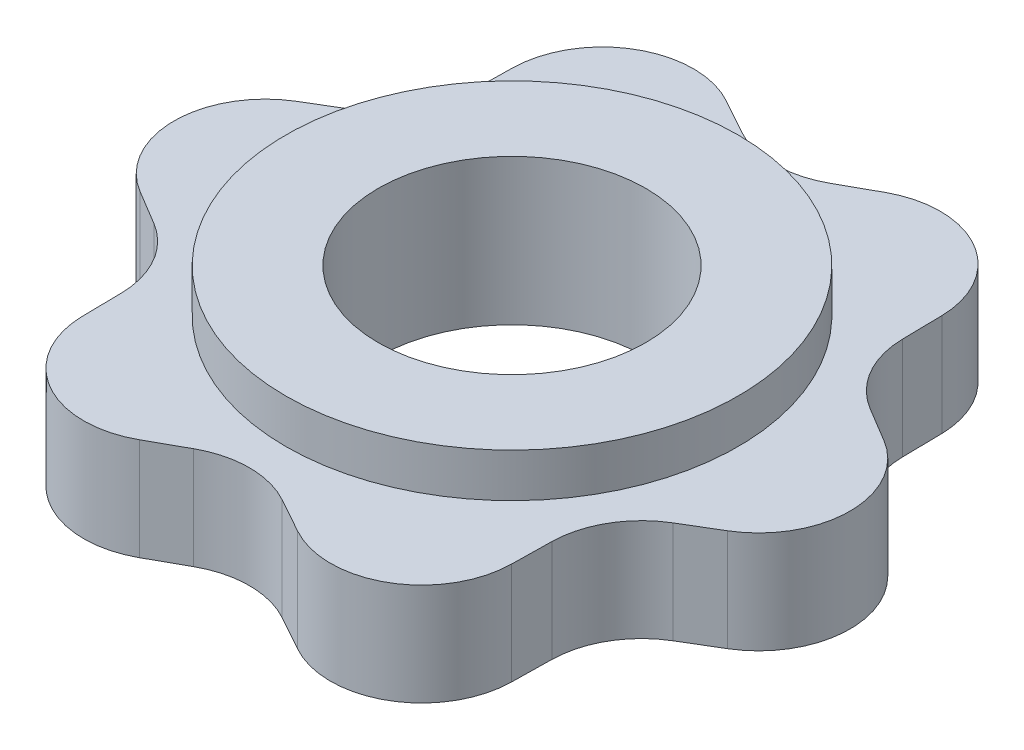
ISO-10303-21;
HEADER;
FILE_DESCRIPTION(('STEP AP214'),'2;1');
FILE_NAME('part.step','',(''),(''),'','','');
FILE_SCHEMA(('AUTOMOTIVE_DESIGN { 1 0 10303 214 1 1 1 1 }'));
ENDSEC;
DATA;
#1=APPLICATION_CONTEXT('core data for automotive mechanical design processes');
#2=APPLICATION_PROTOCOL_DEFINITION('international standard','automotive_design',2000,#1);
#3=PRODUCT_CONTEXT('',#1,'mechanical');
#4=PRODUCT('Part','Part','',(#3));
#5=PRODUCT_RELATED_PRODUCT_CATEGORY('part','',(#4));
#6=PRODUCT_DEFINITION_FORMATION('','',#4);
#7=PRODUCT_DEFINITION_CONTEXT('part definition',#1,'design');
#8=PRODUCT_DEFINITION('design','',#6,#7);
#9=PRODUCT_DEFINITION_SHAPE('','',#8);
#10=(LENGTH_UNIT() NAMED_UNIT(*) SI_UNIT(.MILLI.,.METRE.));
#11=(NAMED_UNIT(*) PLANE_ANGLE_UNIT() SI_UNIT($,.RADIAN.));
#12=(NAMED_UNIT(*) SI_UNIT($,.STERADIAN.) SOLID_ANGLE_UNIT());
#13=UNCERTAINTY_MEASURE_WITH_UNIT(LENGTH_MEASURE(1.E-05),#10,'distance_accuracy_value','');
#14=(GEOMETRIC_REPRESENTATION_CONTEXT(3) GLOBAL_UNCERTAINTY_ASSIGNED_CONTEXT((#13)) GLOBAL_UNIT_ASSIGNED_CONTEXT((#10,
#11,#12)) REPRESENTATION_CONTEXT('',''));
#15=CARTESIAN_POINT('',(0.,0.,0.));
#16=DIRECTION('',(0.,0.,1.));
#17=DIRECTION('',(1.,0.,0.));
#18=AXIS2_PLACEMENT_3D('',#15,#16,#17);
#19=CARTESIAN_POINT('',(0.,10.668,-36.957));
#20=DIRECTION('',(0.,1.,0.));
#21=DIRECTION('',(0.,0.,1.));
#22=AXIS2_PLACEMENT_3D('',#19,#20,#21);
#23=PLANE('',#22);
#24=CARTESIAN_POINT('',(0.,10.668,-36.957));
#25=DIRECTION('',(0.,-1.,0.));
#26=DIRECTION('',(0.,0.,1.));
#27=AXIS2_PLACEMENT_3D('',#24,#25,#26);
#28=CIRCLE('',#27,9.525);
#29=CARTESIAN_POINT('',(4.62754894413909,10.668,-28.6316522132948));
#30=VERTEX_POINT('',#29);
#31=CARTESIAN_POINT('',(-4.62754894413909,10.668,-28.6316522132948));
#32=VERTEX_POINT('',#31);
#33=EDGE_CURVE('E275',#30,#32,#28,.T.);
#34=ORIENTED_EDGE('',*,*,#33,.T.);
#35=DIRECTION('',(-0.874052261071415,0.,-0.485831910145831));
#36=VECTOR('',#35,1.);
#37=CARTESIAN_POINT('',(-8.26295105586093,10.668,-30.6523487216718));
#38=LINE('',#37,#36);
#39=CARTESIAN_POINT('',(-8.26295105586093,10.668,-30.6523487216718));
#40=VERTEX_POINT('',#39);
#41=EDGE_CURVE('E143',#32,#40,#38,.T.);
#42=ORIENTED_EDGE('',*,*,#41,.T.);
#43=CARTESIAN_POINT('',(-12.8905,10.668,-22.3270009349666));
#44=DIRECTION('',(0.,1.,0.));
#45=DIRECTION('',(0.,0.,1.));
#46=AXIS2_PLACEMENT_3D('',#43,#44,#45);
#47=CIRCLE('',#46,9.525);
#48=CARTESIAN_POINT('',(-22.4142371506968,10.668,-22.4820998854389));
#49=VERTEX_POINT('',#48);
#50=EDGE_CURVE('E338',#40,#49,#47,.T.);
#51=ORIENTED_EDGE('',*,*,#50,.T.);
#52=DIRECTION('',(-0.0162833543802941,0.,0.999867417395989));
#53=VECTOR('',#52,1.);
#54=CARTESIAN_POINT('',(-22.4819636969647,10.668,-18.3234010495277));
#55=LINE('',#54,#53);
#56=CARTESIAN_POINT('',(-22.4819636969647,10.668,-18.3234010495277));
#57=VERTEX_POINT('',#56);
#58=EDGE_CURVE('E356',#49,#57,#55,.T.);
#59=ORIENTED_EDGE('',*,*,#58,.T.);
#60=CARTESIAN_POINT('',(-32.0057008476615,10.668,-18.4785));
#61=DIRECTION('',(0.,-1.,0.));
#62=DIRECTION('',(0.,0.,1.));
#63=AXIS2_PLACEMENT_3D('',#60,#61,#62);
#64=CIRCLE('',#63,9.525);
#65=CARTESIAN_POINT('',(-27.1095126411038,10.668,-10.3082511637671));
#66=VERTEX_POINT('',#65);
#67=EDGE_CURVE('E353',#57,#66,#64,.T.);
#68=ORIENTED_EDGE('',*,*,#67,.T.);
#69=DIRECTION('',(-0.857768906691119,0.,0.514035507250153));
#70=VECTOR('',#69,1.);
#71=CARTESIAN_POINT('',(-27.1095126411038,10.668,-10.308251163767));
#72=LINE('',#71,#70);
#73=CARTESIAN_POINT('',(-30.6771882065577,10.668,-8.17024883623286));
#74=VERTEX_POINT('',#73);
#75=EDGE_CURVE('E355',#66,#74,#72,.T.);
#76=ORIENTED_EDGE('',*,*,#75,.T.);
#77=CARTESIAN_POINT('',(-25.781,10.668,0.));
#78=DIRECTION('',(0.,1.,0.));
#79=DIRECTION('',(0.,0.,1.));
#80=AXIS2_PLACEMENT_3D('',#77,#78,#79);
#81=CIRCLE('',#80,9.525);
#82=CARTESIAN_POINT('',(-30.6771882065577,10.668,8.17024883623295));
#83=VERTEX_POINT('',#82);
#84=EDGE_CURVE('E358',#74,#83,#81,.T.);
#85=ORIENTED_EDGE('',*,*,#84,.T.);
#86=DIRECTION('',(0.857768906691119,0.,0.514035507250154));
#87=VECTOR('',#86,1.);
#88=CARTESIAN_POINT('',(-27.1095126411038,10.668,10.3082511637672));
#89=LINE('',#88,#87);
#90=CARTESIAN_POINT('',(-27.1095126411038,10.668,10.3082511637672));
#91=VERTEX_POINT('',#90);
#92=EDGE_CURVE('E364',#83,#91,#89,.T.);
#93=ORIENTED_EDGE('',*,*,#92,.T.);
#94=CARTESIAN_POINT('',(-32.0057008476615,10.668,18.4785000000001));
#95=DIRECTION('',(0.,-1.,0.));
#96=DIRECTION('',(0.,0.,1.));
#97=AXIS2_PLACEMENT_3D('',#94,#95,#96);
#98=CIRCLE('',#97,9.525);
#99=CARTESIAN_POINT('',(-22.4819636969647,10.668,18.3234010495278));
#100=VERTEX_POINT('',#99);
#101=EDGE_CURVE('E366',#91,#100,#98,.T.);
#102=ORIENTED_EDGE('',*,*,#101,.T.);
#103=DIRECTION('',(0.0162833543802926,0.,0.999867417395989));
#104=VECTOR('',#103,1.);
#105=CARTESIAN_POINT('',(-22.4819636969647,10.668,18.3234010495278));
#106=LINE('',#105,#104);
#107=CARTESIAN_POINT('',(-22.4142371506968,10.668,22.4820998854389));
#108=VERTEX_POINT('',#107);
#109=EDGE_CURVE('E368',#100,#108,#106,.T.);
#110=ORIENTED_EDGE('',*,*,#109,.T.);
#111=CARTESIAN_POINT('',(-12.8905,10.668,22.3270009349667));
#112=DIRECTION('',(0.,1.,0.));
#113=DIRECTION('',(0.,0.,1.));
#114=AXIS2_PLACEMENT_3D('',#111,#112,#113);
#115=CIRCLE('',#114,9.525);
#116=CARTESIAN_POINT('',(-8.2629510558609,10.668,30.6523487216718));
#117=VERTEX_POINT('',#116);
#118=EDGE_CURVE('E370',#108,#117,#115,.T.);
#119=ORIENTED_EDGE('',*,*,#118,.T.);
#120=DIRECTION('',(0.874052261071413,0.,-0.485831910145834));
#121=VECTOR('',#120,1.);
#122=CARTESIAN_POINT('',(-4.62754894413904,10.668,28.6316522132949));
#123=LINE('',#122,#121);
#124=CARTESIAN_POINT('',(-4.62754894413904,10.668,28.6316522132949));
#125=VERTEX_POINT('',#124);
#126=EDGE_CURVE('E372',#117,#125,#123,.T.);
#127=ORIENTED_EDGE('',*,*,#126,.T.);
#128=CARTESIAN_POINT('',(0.,10.668,36.9570000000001));
#129=DIRECTION('',(0.,-1.,0.));
#130=DIRECTION('',(0.,0.,1.));
#131=AXIS2_PLACEMENT_3D('',#128,#129,#130);
#132=CIRCLE('',#131,9.525);
#133=CARTESIAN_POINT('',(4.62754894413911,10.668,28.6316522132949));
#134=VERTEX_POINT('',#133);
#135=EDGE_CURVE('E374',#125,#134,#132,.T.);
#136=ORIENTED_EDGE('',*,*,#135,.T.);
#137=DIRECTION('',(0.874052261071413,0.,0.485831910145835));
#138=VECTOR('',#137,1.);
#139=CARTESIAN_POINT('',(4.62754894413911,10.668,28.6316522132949));
#140=LINE('',#139,#138);
#141=CARTESIAN_POINT('',(8.26295105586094,10.668,30.6523487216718));
#142=VERTEX_POINT('',#141);
#143=EDGE_CURVE('E376',#134,#142,#140,.T.);
#144=ORIENTED_EDGE('',*,*,#143,.T.);
#145=CARTESIAN_POINT('',(12.8905,10.668,22.3270009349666));
#146=DIRECTION('',(0.,1.,0.));
#147=DIRECTION('',(0.,0.,1.));
#148=AXIS2_PLACEMENT_3D('',#145,#146,#147);
#149=CIRCLE('',#148,9.525);
#150=CARTESIAN_POINT('',(22.4142371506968,10.668,22.4820998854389));
#151=VERTEX_POINT('',#150);
#152=EDGE_CURVE('E378',#142,#151,#149,.T.);
#153=ORIENTED_EDGE('',*,*,#152,.T.);
#154=DIRECTION('',(0.0162833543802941,0.,-0.999867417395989));
#155=VECTOR('',#154,1.);
#156=CARTESIAN_POINT('',(22.4819636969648,10.668,18.3234010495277));
#157=LINE('',#156,#155);
#158=CARTESIAN_POINT('',(22.4819636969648,10.668,18.3234010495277));
#159=VERTEX_POINT('',#158);
#160=EDGE_CURVE('E380',#151,#159,#157,.T.);
#161=ORIENTED_EDGE('',*,*,#160,.T.);
#162=CARTESIAN_POINT('',(32.0057008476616,10.668,18.4785));
#163=DIRECTION('',(0.,-1.,0.));
#164=DIRECTION('',(0.,0.,1.));
#165=AXIS2_PLACEMENT_3D('',#162,#163,#164);
#166=CIRCLE('',#165,9.525);
#167=CARTESIAN_POINT('',(27.1095126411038,10.668,10.3082511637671));
#168=VERTEX_POINT('',#167);
#169=EDGE_CURVE('E382',#159,#168,#166,.T.);
#170=ORIENTED_EDGE('',*,*,#169,.T.);
#171=DIRECTION('',(0.857768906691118,0.,-0.514035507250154));
#172=VECTOR('',#171,1.);
#173=CARTESIAN_POINT('',(27.1095126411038,10.668,10.3082511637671));
#174=LINE('',#173,#172);
#175=CARTESIAN_POINT('',(30.6771882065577,10.668,8.17024883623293));
#176=VERTEX_POINT('',#175);
#177=EDGE_CURVE('E384',#168,#176,#174,.T.);
#178=ORIENTED_EDGE('',*,*,#177,.T.);
#179=CARTESIAN_POINT('',(25.781,10.668,0.));
#180=DIRECTION('',(0.,1.,0.));
#181=DIRECTION('',(0.,0.,1.));
#182=AXIS2_PLACEMENT_3D('',#179,#180,#181);
#183=CIRCLE('',#182,9.525);
#184=CARTESIAN_POINT('',(30.6771882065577,10.668,-8.17024883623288));
#185=VERTEX_POINT('',#184);
#186=EDGE_CURVE('E386',#176,#185,#183,.T.);
#187=ORIENTED_EDGE('',*,*,#186,.T.);
#188=DIRECTION('',(-0.857768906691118,0.,-0.514035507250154));
#189=VECTOR('',#188,1.);
#190=CARTESIAN_POINT('',(27.1095126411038,10.668,-10.3082511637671));
#191=LINE('',#190,#189);
#192=CARTESIAN_POINT('',(27.1095126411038,10.668,-10.3082511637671));
#193=VERTEX_POINT('',#192);
#194=EDGE_CURVE('E388',#185,#193,#191,.T.);
#195=ORIENTED_EDGE('',*,*,#194,.T.);
#196=CARTESIAN_POINT('',(32.0057008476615,10.668,-18.4785));
#197=DIRECTION('',(0.,-1.,0.));
#198=DIRECTION('',(0.,0.,1.));
#199=AXIS2_PLACEMENT_3D('',#196,#197,#198);
#200=CIRCLE('',#199,9.525);
#201=CARTESIAN_POINT('',(22.4819636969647,10.668,-18.3234010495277));
#202=VERTEX_POINT('',#201);
#203=EDGE_CURVE('E210',#193,#202,#200,.T.);
#204=ORIENTED_EDGE('',*,*,#203,.T.);
#205=DIRECTION('',(-0.0162833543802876,0.,-0.99986741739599));
#206=VECTOR('',#205,1.);
#207=CARTESIAN_POINT('',(22.4142371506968,10.668,-22.4820998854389));
#208=LINE('',#207,#206);
#209=CARTESIAN_POINT('',(22.4142371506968,10.668,-22.4820998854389));
#210=VERTEX_POINT('',#209);
#211=EDGE_CURVE('E204',#202,#210,#208,.T.);
#212=ORIENTED_EDGE('',*,*,#211,.T.);
#213=CARTESIAN_POINT('',(12.8905,10.668,-22.3270009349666));
#214=DIRECTION('',(0.,1.,0.));
#215=DIRECTION('',(0.,0.,1.));
#216=AXIS2_PLACEMENT_3D('',#213,#214,#215);
#217=CIRCLE('',#216,9.525);
#218=CARTESIAN_POINT('',(8.26295105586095,10.668,-30.6523487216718));
#219=VERTEX_POINT('',#218);
#220=EDGE_CURVE('E208',#210,#219,#217,.T.);
#221=ORIENTED_EDGE('',*,*,#220,.T.);
#222=DIRECTION('',(-0.874052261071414,0.,0.485831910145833));
#223=VECTOR('',#222,1.);
#224=CARTESIAN_POINT('',(4.62754894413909,10.668,-28.6316522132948));
#225=LINE('',#224,#223);
#226=EDGE_CURVE('E52',#219,#30,#225,.T.);
#227=ORIENTED_EDGE('',*,*,#226,.T.);
#228=EDGE_LOOP('',(#34,#42,#51,#59,#68,#76,#85,#93,#102,#110,#119,#127,#136,#144,#153,#161,#170,
#178,#187,#195,#204,#212,#221,#227));
#229=FACE_BOUND('',#228,.T.);
#230=CARTESIAN_POINT('',(0.,10.668,0.));
#231=DIRECTION('',(0.,1.,0.));
#232=DIRECTION('',(0.,0.,1.));
#233=AXIS2_PLACEMENT_3D('',#230,#231,#232);
#234=CIRCLE('',#233,23.622);
#235=CARTESIAN_POINT('',(0.,10.668,23.622));
#236=VERTEX_POINT('',#235);
#237=EDGE_CURVE('E440',#236,#236,#234,.T.);
#238=ORIENTED_EDGE('',*,*,#237,.F.);
#239=EDGE_LOOP('',(#238));
#240=FACE_BOUND('',#239,.T.);
#241=ADVANCED_FACE('F35',(#229,#240),#23,.T.);
#242=CARTESIAN_POINT('',(0.,10.668,-36.957));
#243=DIRECTION('',(0.,-1.,0.));
#244=DIRECTION('',(0.,0.,-1.));
#245=AXIS2_PLACEMENT_3D('',#242,#243,#244);
#246=CYLINDRICAL_SURFACE('',#245,9.525);
#247=CARTESIAN_POINT('',(0.,0.,-36.957));
#248=DIRECTION('',(0.,-1.,0.));
#249=DIRECTION('',(0.,0.,1.));
#250=AXIS2_PLACEMENT_3D('',#247,#248,#249);
#251=CIRCLE('',#250,9.525);
#252=CARTESIAN_POINT('',(4.62754894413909,0.,-28.6316522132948));
#253=VERTEX_POINT('',#252);
#254=CARTESIAN_POINT('',(-4.62754894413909,0.,-28.6316522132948));
#255=VERTEX_POINT('',#254);
#256=EDGE_CURVE('E228',#253,#255,#251,.T.);
#257=ORIENTED_EDGE('',*,*,#256,.T.);
#258=DIRECTION('',(0.,-1.,0.));
#259=VECTOR('',#258,1.);
#260=CARTESIAN_POINT('',(-4.62754894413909,10.668,-28.6316522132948));
#261=LINE('',#260,#259);
#262=EDGE_CURVE('E11',#32,#255,#261,.T.);
#263=ORIENTED_EDGE('',*,*,#262,.F.);
#264=ORIENTED_EDGE('',*,*,#33,.F.);
#265=DIRECTION('',(0.,-1.,0.));
#266=VECTOR('',#265,1.);
#267=CARTESIAN_POINT('',(4.62754894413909,10.668,-28.6316522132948));
#268=LINE('',#267,#266);
#269=EDGE_CURVE('E224',#30,#253,#268,.T.);
#270=ORIENTED_EDGE('',*,*,#269,.T.);
#271=EDGE_LOOP('',(#257,#263,#264,#270));
#272=FACE_BOUND('',#271,.T.);
#273=ADVANCED_FACE('F37',(#272),#246,.F.);
#274=CARTESIAN_POINT('',(-8.26295105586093,10.668,-30.6523487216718));
#275=DIRECTION('',(-0.485831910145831,0.,0.874052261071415));
#276=DIRECTION('',(0.874052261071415,0.,0.485831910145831));
#277=AXIS2_PLACEMENT_3D('',#274,#275,#276);
#278=PLANE('',#277);
#279=DIRECTION('',(-0.874052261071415,0.,-0.485831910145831));
#280=VECTOR('',#279,1.);
#281=CARTESIAN_POINT('',(-8.26295105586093,0.,-30.6523487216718));
#282=LINE('',#281,#280);
#283=CARTESIAN_POINT('',(-8.26295105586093,0.,-30.6523487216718));
#284=VERTEX_POINT('',#283);
#285=EDGE_CURVE('E231',#255,#284,#282,.T.);
#286=ORIENTED_EDGE('',*,*,#285,.T.);
#287=DIRECTION('',(0.,-1.,0.));
#288=VECTOR('',#287,1.);
#289=CARTESIAN_POINT('',(-8.26295105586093,10.668,-30.6523487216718));
#290=LINE('',#289,#288);
#291=EDGE_CURVE('E44',#40,#284,#290,.T.);
#292=ORIENTED_EDGE('',*,*,#291,.F.);
#293=ORIENTED_EDGE('',*,*,#41,.F.);
#294=ORIENTED_EDGE('',*,*,#262,.T.);
#295=EDGE_LOOP('',(#286,#292,#293,#294));
#296=FACE_BOUND('',#295,.T.);
#297=ADVANCED_FACE('F418',(#296),#278,.F.);
#298=CARTESIAN_POINT('',(-12.8905,10.668,-22.3270009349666));
#299=DIRECTION('',(0.,-1.,0.));
#300=DIRECTION('',(0.,0.,-1.));
#301=AXIS2_PLACEMENT_3D('',#298,#299,#300);
#302=CYLINDRICAL_SURFACE('',#301,9.525);
#303=CARTESIAN_POINT('',(-12.8905,0.,-22.3270009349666));
#304=DIRECTION('',(0.,1.,0.));
#305=DIRECTION('',(0.,0.,1.));
#306=AXIS2_PLACEMENT_3D('',#303,#304,#305);
#307=CIRCLE('',#306,9.525);
#308=CARTESIAN_POINT('',(-22.4142371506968,0.,-22.4820998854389));
#309=VERTEX_POINT('',#308);
#310=EDGE_CURVE('E234',#284,#309,#307,.T.);
#311=ORIENTED_EDGE('',*,*,#310,.T.);
#312=DIRECTION('',(0.,-1.,0.));
#313=VECTOR('',#312,1.);
#314=CARTESIAN_POINT('',(-22.4142371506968,10.668,-22.4820998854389));
#315=LINE('',#314,#313);
#316=EDGE_CURVE('E330',#49,#309,#315,.T.);
#317=ORIENTED_EDGE('',*,*,#316,.F.);
#318=ORIENTED_EDGE('',*,*,#50,.F.);
#319=ORIENTED_EDGE('',*,*,#291,.T.);
#320=EDGE_LOOP('',(#311,#317,#318,#319));
#321=FACE_BOUND('',#320,.T.);
#322=ADVANCED_FACE('F336',(#321),#302,.T.);
#323=CARTESIAN_POINT('',(-22.4819636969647,10.668,-18.3234010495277));
#324=DIRECTION('',(0.999867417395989,0.,0.0162833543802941));
#325=DIRECTION('',(0.0162833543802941,0.,-0.999867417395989));
#326=AXIS2_PLACEMENT_3D('',#323,#324,#325);
#327=PLANE('',#326);
#328=DIRECTION('',(-0.0162833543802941,0.,0.999867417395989));
#329=VECTOR('',#328,1.);
#330=CARTESIAN_POINT('',(-22.4819636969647,0.,-18.3234010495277));
#331=LINE('',#330,#329);
#332=CARTESIAN_POINT('',(-22.4819636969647,0.,-18.3234010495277));
#333=VERTEX_POINT('',#332);
#334=EDGE_CURVE('E236',#309,#333,#331,.T.);
#335=ORIENTED_EDGE('',*,*,#334,.T.);
#336=DIRECTION('',(0.,-1.,0.));
#337=VECTOR('',#336,1.);
#338=CARTESIAN_POINT('',(-22.4819636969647,10.668,-18.3234010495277));
#339=LINE('',#338,#337);
#340=EDGE_CURVE('E327',#57,#333,#339,.T.);
#341=ORIENTED_EDGE('',*,*,#340,.F.);
#342=ORIENTED_EDGE('',*,*,#58,.F.);
#343=ORIENTED_EDGE('',*,*,#316,.T.);
#344=EDGE_LOOP('',(#335,#341,#342,#343));
#345=FACE_BOUND('',#344,.T.);
#346=ADVANCED_FACE('F347',(#345),#327,.F.);
#347=CARTESIAN_POINT('',(-32.0057008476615,10.668,-18.4785));
#348=DIRECTION('',(0.,-1.,0.));
#349=DIRECTION('',(0.,0.,-1.));
#350=AXIS2_PLACEMENT_3D('',#347,#348,#349);
#351=CYLINDRICAL_SURFACE('',#350,9.525);
#352=CARTESIAN_POINT('',(-32.0057008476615,0.,-18.4785));
#353=DIRECTION('',(0.,-1.,0.));
#354=DIRECTION('',(0.,0.,1.));
#355=AXIS2_PLACEMENT_3D('',#352,#353,#354);
#356=CIRCLE('',#355,9.525);
#357=CARTESIAN_POINT('',(-27.1095126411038,0.,-10.3082511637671));
#358=VERTEX_POINT('',#357);
#359=EDGE_CURVE('E238',#333,#358,#356,.T.);
#360=ORIENTED_EDGE('',*,*,#359,.T.);
#361=DIRECTION('',(0.,-1.,0.));
#362=VECTOR('',#361,1.);
#363=CARTESIAN_POINT('',(-27.1095126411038,10.668,-10.3082511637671));
#364=LINE('',#363,#362);
#365=EDGE_CURVE('E324',#66,#358,#364,.T.);
#366=ORIENTED_EDGE('',*,*,#365,.F.);
#367=ORIENTED_EDGE('',*,*,#67,.F.);
#368=ORIENTED_EDGE('',*,*,#340,.T.);
#369=EDGE_LOOP('',(#360,#366,#367,#368));
#370=FACE_BOUND('',#369,.T.);
#371=ADVANCED_FACE('F351',(#370),#351,.F.);
#372=CARTESIAN_POINT('',(-27.1095126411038,10.668,-10.308251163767));
#373=DIRECTION('',(0.514035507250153,0.,0.857768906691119));
#374=DIRECTION('',(0.857768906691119,0.,-0.514035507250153));
#375=AXIS2_PLACEMENT_3D('',#372,#373,#374);
#376=PLANE('',#375);
#377=DIRECTION('',(-0.857768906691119,0.,0.514035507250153));
#378=VECTOR('',#377,1.);
#379=CARTESIAN_POINT('',(-27.1095126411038,0.,-10.308251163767));
#380=LINE('',#379,#378);
#381=CARTESIAN_POINT('',(-30.6771882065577,0.,-8.17024883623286));
#382=VERTEX_POINT('',#381);
#383=EDGE_CURVE('E240',#358,#382,#380,.T.);
#384=ORIENTED_EDGE('',*,*,#383,.T.);
#385=DIRECTION('',(0.,-1.,0.));
#386=VECTOR('',#385,1.);
#387=CARTESIAN_POINT('',(-30.6771882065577,10.668,-8.17024883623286));
#388=LINE('',#387,#386);
#389=EDGE_CURVE('E321',#74,#382,#388,.T.);
#390=ORIENTED_EDGE('',*,*,#389,.F.);
#391=ORIENTED_EDGE('',*,*,#75,.F.);
#392=ORIENTED_EDGE('',*,*,#365,.T.);
#393=EDGE_LOOP('',(#384,#390,#391,#392));
#394=FACE_BOUND('',#393,.T.);
#395=ADVANCED_FACE('F638',(#394),#376,.F.);
#396=CARTESIAN_POINT('',(-25.781,10.668,0.));
#397=DIRECTION('',(0.,-1.,0.));
#398=DIRECTION('',(0.,0.,-1.));
#399=AXIS2_PLACEMENT_3D('',#396,#397,#398);
#400=CYLINDRICAL_SURFACE('',#399,9.525);
#401=CARTESIAN_POINT('',(-25.781,0.,0.));
#402=DIRECTION('',(0.,1.,0.));
#403=DIRECTION('',(0.,0.,1.));
#404=AXIS2_PLACEMENT_3D('',#401,#402,#403);
#405=CIRCLE('',#404,9.525);
#406=CARTESIAN_POINT('',(-30.6771882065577,0.,8.17024883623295));
#407=VERTEX_POINT('',#406);
#408=EDGE_CURVE('E242',#382,#407,#405,.T.);
#409=ORIENTED_EDGE('',*,*,#408,.T.);
#410=DIRECTION('',(0.,-1.,0.));
#411=VECTOR('',#410,1.);
#412=CARTESIAN_POINT('',(-30.6771882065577,10.668,8.17024883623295));
#413=LINE('',#412,#411);
#414=EDGE_CURVE('E318',#83,#407,#413,.T.);
#415=ORIENTED_EDGE('',*,*,#414,.F.);
#416=ORIENTED_EDGE('',*,*,#84,.F.);
#417=ORIENTED_EDGE('',*,*,#389,.T.);
#418=EDGE_LOOP('',(#409,#415,#416,#417));
#419=FACE_BOUND('',#418,.T.);
#420=ADVANCED_FACE('F628',(#419),#400,.T.);
#421=CARTESIAN_POINT('',(-27.1095126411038,10.668,10.3082511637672));
#422=DIRECTION('',(0.514035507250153,0.,-0.857768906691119));
#423=DIRECTION('',(-0.857768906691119,0.,-0.514035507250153));
#424=AXIS2_PLACEMENT_3D('',#421,#422,#423);
#425=PLANE('',#424);
#426=DIRECTION('',(0.857768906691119,0.,0.514035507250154));
#427=VECTOR('',#426,1.);
#428=CARTESIAN_POINT('',(-27.1095126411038,0.,10.3082511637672));
#429=LINE('',#428,#427);
#430=CARTESIAN_POINT('',(-27.1095126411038,0.,10.3082511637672));
#431=VERTEX_POINT('',#430);
#432=EDGE_CURVE('E244',#407,#431,#429,.T.);
#433=ORIENTED_EDGE('',*,*,#432,.T.);
#434=DIRECTION('',(0.,-1.,0.));
#435=VECTOR('',#434,1.);
#436=CARTESIAN_POINT('',(-27.1095126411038,10.668,10.3082511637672));
#437=LINE('',#436,#435);
#438=EDGE_CURVE('E315',#91,#431,#437,.T.);
#439=ORIENTED_EDGE('',*,*,#438,.F.);
#440=ORIENTED_EDGE('',*,*,#92,.F.);
#441=ORIENTED_EDGE('',*,*,#414,.T.);
#442=EDGE_LOOP('',(#433,#439,#440,#441));
#443=FACE_BOUND('',#442,.T.);
#444=ADVANCED_FACE('F618',(#443),#425,.F.);
#445=CARTESIAN_POINT('',(-32.0057008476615,10.668,18.4785000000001));
#446=DIRECTION('',(0.,-1.,0.));
#447=DIRECTION('',(0.,0.,-1.));
#448=AXIS2_PLACEMENT_3D('',#445,#446,#447);
#449=CYLINDRICAL_SURFACE('',#448,9.525);
#450=CARTESIAN_POINT('',(-32.0057008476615,0.,18.4785000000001));
#451=DIRECTION('',(0.,-1.,0.));
#452=DIRECTION('',(0.,0.,1.));
#453=AXIS2_PLACEMENT_3D('',#450,#451,#452);
#454=CIRCLE('',#453,9.525);
#455=CARTESIAN_POINT('',(-22.4819636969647,0.,18.3234010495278));
#456=VERTEX_POINT('',#455);
#457=EDGE_CURVE('E246',#431,#456,#454,.T.);
#458=ORIENTED_EDGE('',*,*,#457,.T.);
#459=DIRECTION('',(0.,-1.,0.));
#460=VECTOR('',#459,1.);
#461=CARTESIAN_POINT('',(-22.4819636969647,10.668,18.3234010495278));
#462=LINE('',#461,#460);
#463=EDGE_CURVE('E312',#100,#456,#462,.T.);
#464=ORIENTED_EDGE('',*,*,#463,.F.);
#465=ORIENTED_EDGE('',*,*,#101,.F.);
#466=ORIENTED_EDGE('',*,*,#438,.T.);
#467=EDGE_LOOP('',(#458,#464,#465,#466));
#468=FACE_BOUND('',#467,.T.);
#469=ADVANCED_FACE('F608',(#468),#449,.F.);
#470=CARTESIAN_POINT('',(-22.4819636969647,10.668,18.3234010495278));
#471=DIRECTION('',(0.999867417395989,0.,-0.0162833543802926));
#472=DIRECTION('',(-0.0162833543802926,0.,-0.999867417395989));
#473=AXIS2_PLACEMENT_3D('',#470,#471,#472);
#474=PLANE('',#473);
#475=DIRECTION('',(0.0162833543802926,0.,0.999867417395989));
#476=VECTOR('',#475,1.);
#477=CARTESIAN_POINT('',(-22.4819636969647,0.,18.3234010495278));
#478=LINE('',#477,#476);
#479=CARTESIAN_POINT('',(-22.4142371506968,0.,22.4820998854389));
#480=VERTEX_POINT('',#479);
#481=EDGE_CURVE('E248',#456,#480,#478,.T.);
#482=ORIENTED_EDGE('',*,*,#481,.T.);
#483=DIRECTION('',(0.,-1.,0.));
#484=VECTOR('',#483,1.);
#485=CARTESIAN_POINT('',(-22.4142371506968,10.668,22.4820998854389));
#486=LINE('',#485,#484);
#487=EDGE_CURVE('E309',#108,#480,#486,.T.);
#488=ORIENTED_EDGE('',*,*,#487,.F.);
#489=ORIENTED_EDGE('',*,*,#109,.F.);
#490=ORIENTED_EDGE('',*,*,#463,.T.);
#491=EDGE_LOOP('',(#482,#488,#489,#490));
#492=FACE_BOUND('',#491,.T.);
#493=ADVANCED_FACE('F598',(#492),#474,.F.);
#494=CARTESIAN_POINT('',(-12.8905,10.668,22.3270009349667));
#495=DIRECTION('',(0.,-1.,0.));
#496=DIRECTION('',(0.,0.,-1.));
#497=AXIS2_PLACEMENT_3D('',#494,#495,#496);
#498=CYLINDRICAL_SURFACE('',#497,9.525);
#499=CARTESIAN_POINT('',(-12.8905,0.,22.3270009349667));
#500=DIRECTION('',(0.,1.,0.));
#501=DIRECTION('',(0.,0.,1.));
#502=AXIS2_PLACEMENT_3D('',#499,#500,#501);
#503=CIRCLE('',#502,9.525);
#504=CARTESIAN_POINT('',(-8.2629510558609,0.,30.6523487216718));
#505=VERTEX_POINT('',#504);
#506=EDGE_CURVE('E250',#480,#505,#503,.T.);
#507=ORIENTED_EDGE('',*,*,#506,.T.);
#508=DIRECTION('',(0.,-1.,0.));
#509=VECTOR('',#508,1.);
#510=CARTESIAN_POINT('',(-8.2629510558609,10.668,30.6523487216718));
#511=LINE('',#510,#509);
#512=EDGE_CURVE('E306',#117,#505,#511,.T.);
#513=ORIENTED_EDGE('',*,*,#512,.F.);
#514=ORIENTED_EDGE('',*,*,#118,.F.);
#515=ORIENTED_EDGE('',*,*,#487,.T.);
#516=EDGE_LOOP('',(#507,#513,#514,#515));
#517=FACE_BOUND('',#516,.T.);
#518=ADVANCED_FACE('F588',(#517),#498,.T.);
#519=CARTESIAN_POINT('',(-4.62754894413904,10.668,28.6316522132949));
#520=DIRECTION('',(-0.485831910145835,0.,-0.874052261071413));
#521=DIRECTION('',(-0.874052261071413,0.,0.485831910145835));
#522=AXIS2_PLACEMENT_3D('',#519,#520,#521);
#523=PLANE('',#522);
#524=DIRECTION('',(0.874052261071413,0.,-0.485831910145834));
#525=VECTOR('',#524,1.);
#526=CARTESIAN_POINT('',(-4.62754894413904,0.,28.6316522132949));
#527=LINE('',#526,#525);
#528=CARTESIAN_POINT('',(-4.62754894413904,0.,28.6316522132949));
#529=VERTEX_POINT('',#528);
#530=EDGE_CURVE('E252',#505,#529,#527,.T.);
#531=ORIENTED_EDGE('',*,*,#530,.T.);
#532=DIRECTION('',(0.,-1.,0.));
#533=VECTOR('',#532,1.);
#534=CARTESIAN_POINT('',(-4.62754894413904,10.668,28.6316522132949));
#535=LINE('',#534,#533);
#536=EDGE_CURVE('E303',#125,#529,#535,.T.);
#537=ORIENTED_EDGE('',*,*,#536,.F.);
#538=ORIENTED_EDGE('',*,*,#126,.F.);
#539=ORIENTED_EDGE('',*,*,#512,.T.);
#540=EDGE_LOOP('',(#531,#537,#538,#539));
#541=FACE_BOUND('',#540,.T.);
#542=ADVANCED_FACE('F578',(#541),#523,.F.);
#543=CARTESIAN_POINT('',(0.,10.668,36.9570000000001));
#544=DIRECTION('',(0.,-1.,0.));
#545=DIRECTION('',(0.,0.,-1.));
#546=AXIS2_PLACEMENT_3D('',#543,#544,#545);
#547=CYLINDRICAL_SURFACE('',#546,9.525);
#548=CARTESIAN_POINT('',(0.,0.,36.9570000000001));
#549=DIRECTION('',(0.,-1.,0.));
#550=DIRECTION('',(0.,0.,1.));
#551=AXIS2_PLACEMENT_3D('',#548,#549,#550);
#552=CIRCLE('',#551,9.525);
#553=CARTESIAN_POINT('',(4.62754894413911,0.,28.6316522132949));
#554=VERTEX_POINT('',#553);
#555=EDGE_CURVE('E254',#529,#554,#552,.T.);
#556=ORIENTED_EDGE('',*,*,#555,.T.);
#557=DIRECTION('',(0.,-1.,0.));
#558=VECTOR('',#557,1.);
#559=CARTESIAN_POINT('',(4.62754894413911,10.668,28.6316522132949));
#560=LINE('',#559,#558);
#561=EDGE_CURVE('E300',#134,#554,#560,.T.);
#562=ORIENTED_EDGE('',*,*,#561,.F.);
#563=ORIENTED_EDGE('',*,*,#135,.F.);
#564=ORIENTED_EDGE('',*,*,#536,.T.);
#565=EDGE_LOOP('',(#556,#562,#563,#564));
#566=FACE_BOUND('',#565,.T.);
#567=ADVANCED_FACE('F568',(#566),#547,.F.);
#568=CARTESIAN_POINT('',(4.62754894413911,10.668,28.6316522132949));
#569=DIRECTION('',(0.485831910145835,0.,-0.874052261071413));
#570=DIRECTION('',(-0.874052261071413,0.,-0.485831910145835));
#571=AXIS2_PLACEMENT_3D('',#568,#569,#570);
#572=PLANE('',#571);
#573=DIRECTION('',(0.874052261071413,0.,0.485831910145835));
#574=VECTOR('',#573,1.);
#575=CARTESIAN_POINT('',(4.62754894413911,0.,28.6316522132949));
#576=LINE('',#575,#574);
#577=CARTESIAN_POINT('',(8.26295105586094,0.,30.6523487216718));
#578=VERTEX_POINT('',#577);
#579=EDGE_CURVE('E256',#554,#578,#576,.T.);
#580=ORIENTED_EDGE('',*,*,#579,.T.);
#581=DIRECTION('',(0.,-1.,0.));
#582=VECTOR('',#581,1.);
#583=CARTESIAN_POINT('',(8.26295105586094,10.668,30.6523487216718));
#584=LINE('',#583,#582);
#585=EDGE_CURVE('E297',#142,#578,#584,.T.);
#586=ORIENTED_EDGE('',*,*,#585,.F.);
#587=ORIENTED_EDGE('',*,*,#143,.F.);
#588=ORIENTED_EDGE('',*,*,#561,.T.);
#589=EDGE_LOOP('',(#580,#586,#587,#588));
#590=FACE_BOUND('',#589,.T.);
#591=ADVANCED_FACE('F558',(#590),#572,.F.);
#592=CARTESIAN_POINT('',(12.8905,10.668,22.3270009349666));
#593=DIRECTION('',(0.,-1.,0.));
#594=DIRECTION('',(0.,0.,-1.));
#595=AXIS2_PLACEMENT_3D('',#592,#593,#594);
#596=CYLINDRICAL_SURFACE('',#595,9.525);
#597=CARTESIAN_POINT('',(12.8905,0.,22.3270009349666));
#598=DIRECTION('',(0.,1.,0.));
#599=DIRECTION('',(0.,0.,1.));
#600=AXIS2_PLACEMENT_3D('',#597,#598,#599);
#601=CIRCLE('',#600,9.525);
#602=CARTESIAN_POINT('',(22.4142371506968,0.,22.4820998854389));
#603=VERTEX_POINT('',#602);
#604=EDGE_CURVE('E258',#578,#603,#601,.T.);
#605=ORIENTED_EDGE('',*,*,#604,.T.);
#606=DIRECTION('',(0.,-1.,0.));
#607=VECTOR('',#606,1.);
#608=CARTESIAN_POINT('',(22.4142371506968,10.668,22.4820998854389));
#609=LINE('',#608,#607);
#610=EDGE_CURVE('E294',#151,#603,#609,.T.);
#611=ORIENTED_EDGE('',*,*,#610,.F.);
#612=ORIENTED_EDGE('',*,*,#152,.F.);
#613=ORIENTED_EDGE('',*,*,#585,.T.);
#614=EDGE_LOOP('',(#605,#611,#612,#613));
#615=FACE_BOUND('',#614,.T.);
#616=ADVANCED_FACE('F548',(#615),#596,.T.);
#617=CARTESIAN_POINT('',(22.4819636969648,10.668,18.3234010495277));
#618=DIRECTION('',(-0.999867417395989,0.,-0.0162833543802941));
#619=DIRECTION('',(-0.0162833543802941,0.,0.999867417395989));
#620=AXIS2_PLACEMENT_3D('',#617,#618,#619);
#621=PLANE('',#620);
#622=DIRECTION('',(0.0162833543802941,0.,-0.999867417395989));
#623=VECTOR('',#622,1.);
#624=CARTESIAN_POINT('',(22.4819636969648,0.,18.3234010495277));
#625=LINE('',#624,#623);
#626=CARTESIAN_POINT('',(22.4819636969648,0.,18.3234010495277));
#627=VERTEX_POINT('',#626);
#628=EDGE_CURVE('E260',#603,#627,#625,.T.);
#629=ORIENTED_EDGE('',*,*,#628,.T.);
#630=DIRECTION('',(0.,-1.,0.));
#631=VECTOR('',#630,1.);
#632=CARTESIAN_POINT('',(22.4819636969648,10.668,18.3234010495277));
#633=LINE('',#632,#631);
#634=EDGE_CURVE('E291',#159,#627,#633,.T.);
#635=ORIENTED_EDGE('',*,*,#634,.F.);
#636=ORIENTED_EDGE('',*,*,#160,.F.);
#637=ORIENTED_EDGE('',*,*,#610,.T.);
#638=EDGE_LOOP('',(#629,#635,#636,#637));
#639=FACE_BOUND('',#638,.T.);
#640=ADVANCED_FACE('F538',(#639),#621,.F.);
#641=CARTESIAN_POINT('',(32.0057008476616,10.668,18.4785));
#642=DIRECTION('',(0.,-1.,0.));
#643=DIRECTION('',(0.,0.,-1.));
#644=AXIS2_PLACEMENT_3D('',#641,#642,#643);
#645=CYLINDRICAL_SURFACE('',#644,9.525);
#646=CARTESIAN_POINT('',(32.0057008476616,0.,18.4785));
#647=DIRECTION('',(0.,-1.,0.));
#648=DIRECTION('',(0.,0.,1.));
#649=AXIS2_PLACEMENT_3D('',#646,#647,#648);
#650=CIRCLE('',#649,9.525);
#651=CARTESIAN_POINT('',(27.1095126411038,0.,10.3082511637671));
#652=VERTEX_POINT('',#651);
#653=EDGE_CURVE('E262',#627,#652,#650,.T.);
#654=ORIENTED_EDGE('',*,*,#653,.T.);
#655=DIRECTION('',(0.,-1.,0.));
#656=VECTOR('',#655,1.);
#657=CARTESIAN_POINT('',(27.1095126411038,10.668,10.3082511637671));
#658=LINE('',#657,#656);
#659=EDGE_CURVE('E288',#168,#652,#658,.T.);
#660=ORIENTED_EDGE('',*,*,#659,.F.);
#661=ORIENTED_EDGE('',*,*,#169,.F.);
#662=ORIENTED_EDGE('',*,*,#634,.T.);
#663=EDGE_LOOP('',(#654,#660,#661,#662));
#664=FACE_BOUND('',#663,.T.);
#665=ADVANCED_FACE('F528',(#664),#645,.F.);
#666=CARTESIAN_POINT('',(27.1095126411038,10.668,10.3082511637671));
#667=DIRECTION('',(-0.514035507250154,0.,-0.857768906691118));
#668=DIRECTION('',(-0.857768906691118,0.,0.514035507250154));
#669=AXIS2_PLACEMENT_3D('',#666,#667,#668);
#670=PLANE('',#669);
#671=DIRECTION('',(0.857768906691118,0.,-0.514035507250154));
#672=VECTOR('',#671,1.);
#673=CARTESIAN_POINT('',(27.1095126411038,0.,10.3082511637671));
#674=LINE('',#673,#672);
#675=CARTESIAN_POINT('',(30.6771882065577,0.,8.17024883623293));
#676=VERTEX_POINT('',#675);
#677=EDGE_CURVE('E264',#652,#676,#674,.T.);
#678=ORIENTED_EDGE('',*,*,#677,.T.);
#679=DIRECTION('',(0.,-1.,0.));
#680=VECTOR('',#679,1.);
#681=CARTESIAN_POINT('',(30.6771882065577,10.668,8.17024883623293));
#682=LINE('',#681,#680);
#683=EDGE_CURVE('E285',#176,#676,#682,.T.);
#684=ORIENTED_EDGE('',*,*,#683,.F.);
#685=ORIENTED_EDGE('',*,*,#177,.F.);
#686=ORIENTED_EDGE('',*,*,#659,.T.);
#687=EDGE_LOOP('',(#678,#684,#685,#686));
#688=FACE_BOUND('',#687,.T.);
#689=ADVANCED_FACE('F518',(#688),#670,.F.);
#690=CARTESIAN_POINT('',(25.781,10.668,0.));
#691=DIRECTION('',(0.,-1.,0.));
#692=DIRECTION('',(0.,0.,-1.));
#693=AXIS2_PLACEMENT_3D('',#690,#691,#692);
#694=CYLINDRICAL_SURFACE('',#693,9.525);
#695=CARTESIAN_POINT('',(25.781,0.,0.));
#696=DIRECTION('',(0.,1.,0.));
#697=DIRECTION('',(0.,0.,1.));
#698=AXIS2_PLACEMENT_3D('',#695,#696,#697);
#699=CIRCLE('',#698,9.525);
#700=CARTESIAN_POINT('',(30.6771882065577,0.,-8.17024883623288));
#701=VERTEX_POINT('',#700);
#702=EDGE_CURVE('E266',#676,#701,#699,.T.);
#703=ORIENTED_EDGE('',*,*,#702,.T.);
#704=DIRECTION('',(0.,-1.,0.));
#705=VECTOR('',#704,1.);
#706=CARTESIAN_POINT('',(30.6771882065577,10.668,-8.17024883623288));
#707=LINE('',#706,#705);
#708=EDGE_CURVE('E282',#185,#701,#707,.T.);
#709=ORIENTED_EDGE('',*,*,#708,.F.);
#710=ORIENTED_EDGE('',*,*,#186,.F.);
#711=ORIENTED_EDGE('',*,*,#683,.T.);
#712=EDGE_LOOP('',(#703,#709,#710,#711));
#713=FACE_BOUND('',#712,.T.);
#714=ADVANCED_FACE('F509',(#713),#694,.T.);
#715=CARTESIAN_POINT('',(27.1095126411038,10.668,-10.3082511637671));
#716=DIRECTION('',(-0.514035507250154,0.,0.857768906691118));
#717=DIRECTION('',(0.857768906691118,0.,0.514035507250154));
#718=AXIS2_PLACEMENT_3D('',#715,#716,#717);
#719=PLANE('',#718);
#720=DIRECTION('',(-0.857768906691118,0.,-0.514035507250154));
#721=VECTOR('',#720,1.);
#722=CARTESIAN_POINT('',(27.1095126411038,0.,-10.3082511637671));
#723=LINE('',#722,#721);
#724=CARTESIAN_POINT('',(27.1095126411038,0.,-10.3082511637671));
#725=VERTEX_POINT('',#724);
#726=EDGE_CURVE('E268',#701,#725,#723,.T.);
#727=ORIENTED_EDGE('',*,*,#726,.T.);
#728=DIRECTION('',(0.,-1.,0.));
#729=VECTOR('',#728,1.);
#730=CARTESIAN_POINT('',(27.1095126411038,10.668,-10.3082511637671));
#731=LINE('',#730,#729);
#732=EDGE_CURVE('E279',#193,#725,#731,.T.);
#733=ORIENTED_EDGE('',*,*,#732,.F.);
#734=ORIENTED_EDGE('',*,*,#194,.F.);
#735=ORIENTED_EDGE('',*,*,#708,.T.);
#736=EDGE_LOOP('',(#727,#733,#734,#735));
#737=FACE_BOUND('',#736,.T.);
#738=ADVANCED_FACE('F394',(#737),#719,.F.);
#739=CARTESIAN_POINT('',(32.0057008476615,10.668,-18.4785));
#740=DIRECTION('',(0.,-1.,0.));
#741=DIRECTION('',(0.,0.,-1.));
#742=AXIS2_PLACEMENT_3D('',#739,#740,#741);
#743=CYLINDRICAL_SURFACE('',#742,9.525);
#744=CARTESIAN_POINT('',(32.0057008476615,0.,-18.4785));
#745=DIRECTION('',(0.,-1.,0.));
#746=DIRECTION('',(0.,0.,1.));
#747=AXIS2_PLACEMENT_3D('',#744,#745,#746);
#748=CIRCLE('',#747,9.525);
#749=CARTESIAN_POINT('',(22.4819636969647,0.,-18.3234010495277));
#750=VERTEX_POINT('',#749);
#751=EDGE_CURVE('E270',#725,#750,#748,.T.);
#752=ORIENTED_EDGE('',*,*,#751,.T.);
#753=DIRECTION('',(0.,-1.,0.));
#754=VECTOR('',#753,1.);
#755=CARTESIAN_POINT('',(22.4819636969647,10.668,-18.3234010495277));
#756=LINE('',#755,#754);
#757=EDGE_CURVE('E219',#202,#750,#756,.T.);
#758=ORIENTED_EDGE('',*,*,#757,.F.);
#759=ORIENTED_EDGE('',*,*,#203,.F.);
#760=ORIENTED_EDGE('',*,*,#732,.T.);
#761=EDGE_LOOP('',(#752,#758,#759,#760));
#762=FACE_BOUND('',#761,.T.);
#763=ADVANCED_FACE('F398',(#762),#743,.F.);
#764=CARTESIAN_POINT('',(22.4142371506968,10.668,-22.4820998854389));
#765=DIRECTION('',(-0.99986741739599,0.,0.0162833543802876));
#766=DIRECTION('',(0.0162833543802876,0.,0.999867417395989));
#767=AXIS2_PLACEMENT_3D('',#764,#765,#766);
#768=PLANE('',#767);
#769=DIRECTION('',(-0.0162833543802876,0.,-0.99986741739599));
#770=VECTOR('',#769,1.);
#771=CARTESIAN_POINT('',(22.4142371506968,0.,-22.4820998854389));
#772=LINE('',#771,#770);
#773=CARTESIAN_POINT('',(22.4142371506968,0.,-22.4820998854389));
#774=VERTEX_POINT('',#773);
#775=EDGE_CURVE('E218',#750,#774,#772,.T.);
#776=ORIENTED_EDGE('',*,*,#775,.T.);
#777=DIRECTION('',(0.,-1.,0.));
#778=VECTOR('',#777,1.);
#779=CARTESIAN_POINT('',(22.4142371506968,10.668,-22.4820998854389));
#780=LINE('',#779,#778);
#781=EDGE_CURVE('E215',#210,#774,#780,.T.);
#782=ORIENTED_EDGE('',*,*,#781,.F.);
#783=ORIENTED_EDGE('',*,*,#211,.F.);
#784=ORIENTED_EDGE('',*,*,#757,.T.);
#785=EDGE_LOOP('',(#776,#782,#783,#784));
#786=FACE_BOUND('',#785,.T.);
#787=ADVANCED_FACE('F216',(#786),#768,.F.);
#788=CARTESIAN_POINT('',(12.8905,10.668,-22.3270009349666));
#789=DIRECTION('',(0.,-1.,0.));
#790=DIRECTION('',(0.,0.,-1.));
#791=AXIS2_PLACEMENT_3D('',#788,#789,#790);
#792=CYLINDRICAL_SURFACE('',#791,9.525);
#793=CARTESIAN_POINT('',(12.8905,0.,-22.3270009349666));
#794=DIRECTION('',(0.,1.,0.));
#795=DIRECTION('',(0.,0.,1.));
#796=AXIS2_PLACEMENT_3D('',#793,#794,#795);
#797=CIRCLE('',#796,9.525);
#798=CARTESIAN_POINT('',(8.26295105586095,0.,-30.6523487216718));
#799=VERTEX_POINT('',#798);
#800=EDGE_CURVE('E129',#774,#799,#797,.T.);
#801=ORIENTED_EDGE('',*,*,#800,.T.);
#802=DIRECTION('',(0.,-1.,0.));
#803=VECTOR('',#802,1.);
#804=CARTESIAN_POINT('',(8.26295105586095,10.668,-30.6523487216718));
#805=LINE('',#804,#803);
#806=EDGE_CURVE('E220',#219,#799,#805,.T.);
#807=ORIENTED_EDGE('',*,*,#806,.F.);
#808=ORIENTED_EDGE('',*,*,#220,.F.);
#809=ORIENTED_EDGE('',*,*,#781,.T.);
#810=EDGE_LOOP('',(#801,#807,#808,#809));
#811=FACE_BOUND('',#810,.T.);
#812=ADVANCED_FACE('F222',(#811),#792,.T.);
#813=CARTESIAN_POINT('',(4.62754894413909,10.668,-28.6316522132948));
#814=DIRECTION('',(0.485831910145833,0.,0.874052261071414));
#815=DIRECTION('',(0.874052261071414,0.,-0.485831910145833));
#816=AXIS2_PLACEMENT_3D('',#813,#814,#815);
#817=PLANE('',#816);
#818=DIRECTION('',(-0.874052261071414,0.,0.485831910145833));
#819=VECTOR('',#818,1.);
#820=CARTESIAN_POINT('',(4.62754894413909,0.,-28.6316522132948));
#821=LINE('',#820,#819);
#822=EDGE_CURVE('E135',#799,#253,#821,.T.);
#823=ORIENTED_EDGE('',*,*,#822,.T.);
#824=ORIENTED_EDGE('',*,*,#269,.F.);
#825=ORIENTED_EDGE('',*,*,#226,.F.);
#826=ORIENTED_EDGE('',*,*,#806,.T.);
#827=EDGE_LOOP('',(#823,#824,#825,#826));
#828=FACE_BOUND('',#827,.T.);
#829=ADVANCED_FACE('F402',(#828),#817,.F.);
#830=CARTESIAN_POINT('',(0.,0.,-36.957));
#831=DIRECTION('',(0.,1.,0.));
#832=DIRECTION('',(0.,0.,1.));
#833=AXIS2_PLACEMENT_3D('',#830,#831,#832);
#834=PLANE('',#833);
#835=CARTESIAN_POINT('',(0.,0.,0.));
#836=DIRECTION('',(0.,1.,0.));
#837=DIRECTION('',(0.,0.,1.));
#838=AXIS2_PLACEMENT_3D('',#835,#836,#837);
#839=CIRCLE('',#838,13.97);
#840=CARTESIAN_POINT('',(0.,0.,13.97));
#841=VERTEX_POINT('',#840);
#842=EDGE_CURVE('E435',#841,#841,#839,.T.);
#843=ORIENTED_EDGE('',*,*,#842,.T.);
#844=EDGE_LOOP('',(#843));
#845=FACE_BOUND('',#844,.T.);
#846=ORIENTED_EDGE('',*,*,#256,.F.);
#847=ORIENTED_EDGE('',*,*,#822,.F.);
#848=ORIENTED_EDGE('',*,*,#800,.F.);
#849=ORIENTED_EDGE('',*,*,#775,.F.);
#850=ORIENTED_EDGE('',*,*,#751,.F.);
#851=ORIENTED_EDGE('',*,*,#726,.F.);
#852=ORIENTED_EDGE('',*,*,#702,.F.);
#853=ORIENTED_EDGE('',*,*,#677,.F.);
#854=ORIENTED_EDGE('',*,*,#653,.F.);
#855=ORIENTED_EDGE('',*,*,#628,.F.);
#856=ORIENTED_EDGE('',*,*,#604,.F.);
#857=ORIENTED_EDGE('',*,*,#579,.F.);
#858=ORIENTED_EDGE('',*,*,#555,.F.);
#859=ORIENTED_EDGE('',*,*,#530,.F.);
#860=ORIENTED_EDGE('',*,*,#506,.F.);
#861=ORIENTED_EDGE('',*,*,#481,.F.);
#862=ORIENTED_EDGE('',*,*,#457,.F.);
#863=ORIENTED_EDGE('',*,*,#432,.F.);
#864=ORIENTED_EDGE('',*,*,#408,.F.);
#865=ORIENTED_EDGE('',*,*,#383,.F.);
#866=ORIENTED_EDGE('',*,*,#359,.F.);
#867=ORIENTED_EDGE('',*,*,#334,.F.);
#868=ORIENTED_EDGE('',*,*,#310,.F.);
#869=ORIENTED_EDGE('',*,*,#285,.F.);
#870=EDGE_LOOP('',(#846,#847,#848,#849,#850,#851,#852,#853,#854,#855,#856,#857,#858,#859,#860,
#861,#862,#863,#864,#865,#866,#867,#868,#869));
#871=FACE_BOUND('',#870,.T.);
#872=ADVANCED_FACE('F342',(#845,#871),#834,.F.);
#873=CARTESIAN_POINT('',(0.,15.24,0.));
#874=DIRECTION('',(0.,-1.,0.));
#875=DIRECTION('',(0.,0.,-1.));
#876=AXIS2_PLACEMENT_3D('',#873,#874,#875);
#877=CYLINDRICAL_SURFACE('',#876,23.622);
#878=CARTESIAN_POINT('',(0.,15.24,0.));
#879=DIRECTION('',(0.,1.,0.));
#880=DIRECTION('',(0.,0.,1.));
#881=AXIS2_PLACEMENT_3D('',#878,#879,#880);
#882=CIRCLE('',#881,23.622);
#883=CARTESIAN_POINT('',(0.,15.24,23.622));
#884=VERTEX_POINT('',#883);
#885=EDGE_CURVE('E232',#884,#884,#882,.T.);
#886=ORIENTED_EDGE('',*,*,#885,.F.);
#887=EDGE_LOOP('',(#886));
#888=FACE_BOUND('',#887,.T.);
#889=ORIENTED_EDGE('',*,*,#237,.T.);
#890=EDGE_LOOP('',(#889));
#891=FACE_BOUND('',#890,.T.);
#892=ADVANCED_FACE('F409',(#888,#891),#877,.T.);
#893=CARTESIAN_POINT('',(0.,15.24,0.));
#894=DIRECTION('',(0.,1.,0.));
#895=DIRECTION('',(0.,0.,1.));
#896=AXIS2_PLACEMENT_3D('',#893,#894,#895);
#897=PLANE('',#896);
#898=CARTESIAN_POINT('',(0.,15.24,0.));
#899=DIRECTION('',(0.,1.,0.));
#900=DIRECTION('',(0.,0.,1.));
#901=AXIS2_PLACEMENT_3D('',#898,#899,#900);
#902=CIRCLE('',#901,13.97);
#903=CARTESIAN_POINT('',(0.,15.24,13.97));
#904=VERTEX_POINT('',#903);
#905=EDGE_CURVE('E438',#904,#904,#902,.T.);
#906=ORIENTED_EDGE('',*,*,#905,.F.);
#907=EDGE_LOOP('',(#906));
#908=FACE_BOUND('',#907,.T.);
#909=ORIENTED_EDGE('',*,*,#885,.T.);
#910=EDGE_LOOP('',(#909));
#911=FACE_BOUND('',#910,.T.);
#912=ADVANCED_FACE('F422',(#908,#911),#897,.T.);
#913=CARTESIAN_POINT('',(0.,0.,0.));
#914=DIRECTION('',(0.,1.,0.));
#915=DIRECTION('',(0.,0.,1.));
#916=AXIS2_PLACEMENT_3D('',#913,#914,#915);
#917=CYLINDRICAL_SURFACE('',#916,13.97);
#918=ORIENTED_EDGE('',*,*,#842,.F.);
#919=EDGE_LOOP('',(#918));
#920=FACE_BOUND('',#919,.T.);
#921=ORIENTED_EDGE('',*,*,#905,.T.);
#922=EDGE_LOOP('',(#921));
#923=FACE_BOUND('',#922,.T.);
#924=ADVANCED_FACE('F426',(#920,#923),#917,.F.);
#925=CLOSED_SHELL('',(#241,#273,#297,#322,#346,#371,#395,#420,#444,#469,#493,#518,#542,#567,
#591,#616,#640,#665,#689,#714,#738,#763,#787,#812,#829,#872,#892,#912,#924));
#926=MANIFOLD_SOLID_BREP('B2',#925);
#927=ADVANCED_BREP_SHAPE_REPRESENTATION('',(#18,#926),#14);
#928=SHAPE_DEFINITION_REPRESENTATION(#9,#927);
ENDSEC;
END-ISO-10303-21;
